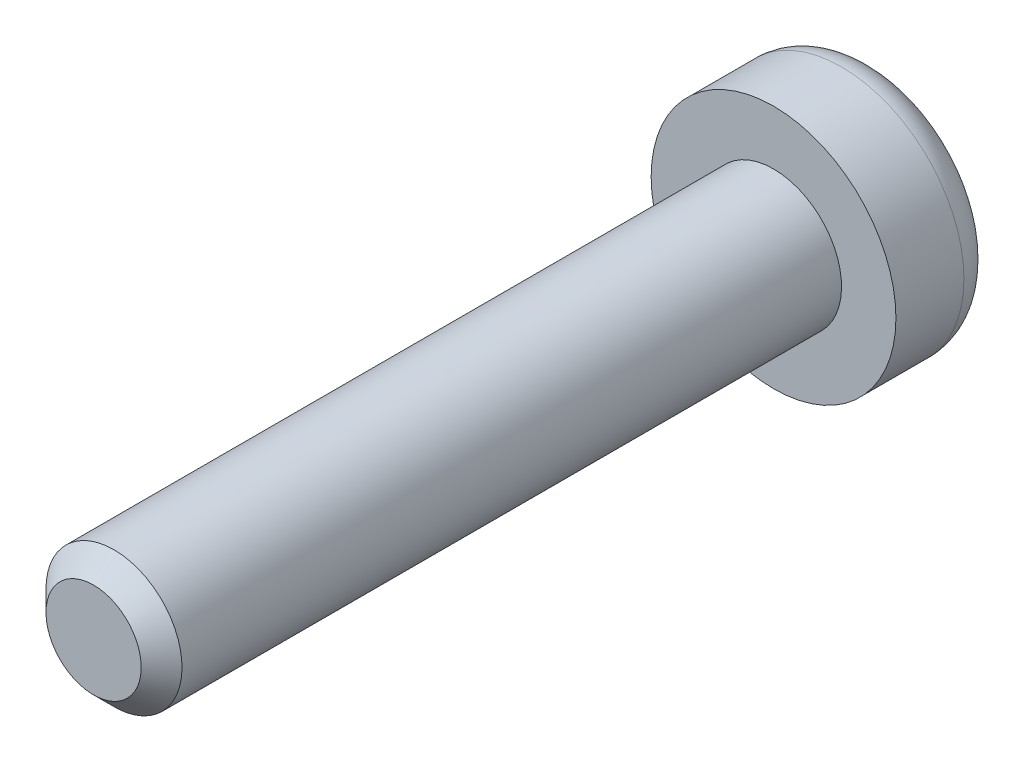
ISO-10303-21;
HEADER;
FILE_DESCRIPTION(('STEP AP214'),'2;1');
FILE_NAME('part.step','',(''),(''),'','','');
FILE_SCHEMA(('AUTOMOTIVE_DESIGN { 1 0 10303 214 1 1 1 1 }'));
ENDSEC;
DATA;
#1=APPLICATION_CONTEXT('core data for automotive mechanical design processes');
#2=APPLICATION_PROTOCOL_DEFINITION('international standard','automotive_design',2000,#1);
#3=PRODUCT_CONTEXT('',#1,'mechanical');
#4=PRODUCT('Part','Part','',(#3));
#5=PRODUCT_RELATED_PRODUCT_CATEGORY('part','',(#4));
#6=PRODUCT_DEFINITION_FORMATION('','',#4);
#7=PRODUCT_DEFINITION_CONTEXT('part definition',#1,'design');
#8=PRODUCT_DEFINITION('design','',#6,#7);
#9=PRODUCT_DEFINITION_SHAPE('','',#8);
#10=(LENGTH_UNIT() NAMED_UNIT(*) SI_UNIT(.MILLI.,.METRE.));
#11=(NAMED_UNIT(*) PLANE_ANGLE_UNIT() SI_UNIT($,.RADIAN.));
#12=(NAMED_UNIT(*) SI_UNIT($,.STERADIAN.) SOLID_ANGLE_UNIT());
#13=UNCERTAINTY_MEASURE_WITH_UNIT(LENGTH_MEASURE(1.E-05),#10,'distance_accuracy_value','');
#14=(GEOMETRIC_REPRESENTATION_CONTEXT(3) GLOBAL_UNCERTAINTY_ASSIGNED_CONTEXT((#13)) GLOBAL_UNIT_ASSIGNED_CONTEXT((#10,
#11,#12)) REPRESENTATION_CONTEXT('',''));
#15=CARTESIAN_POINT('',(0.,0.,0.));
#16=DIRECTION('',(0.,0.,1.));
#17=DIRECTION('',(1.,0.,0.));
#18=AXIS2_PLACEMENT_3D('',#15,#16,#17);
#19=CARTESIAN_POINT('',(1.9,0.,3.));
#20=DIRECTION('',(0.,0.,-1.));
#21=DIRECTION('',(0.,1.,0.));
#22=AXIS2_PLACEMENT_3D('',#19,#20,#21);
#23=PLANE('',#22);
#24=CARTESIAN_POINT('',(0.,0.,3.));
#25=DIRECTION('',(0.,0.,1.));
#26=DIRECTION('',(0.,-1.,0.));
#27=AXIS2_PLACEMENT_3D('',#24,#25,#26);
#28=CIRCLE('',#27,3.6);
#29=CARTESIAN_POINT('',(0.,-3.6,3.));
#30=VERTEX_POINT('',#29);
#31=EDGE_CURVE('E46',#30,#30,#28,.F.);
#32=ORIENTED_EDGE('',*,*,#31,.F.);
#33=EDGE_LOOP('',(#32));
#34=FACE_BOUND('',#33,.T.);
#35=CARTESIAN_POINT('',(0.,0.,3.));
#36=DIRECTION('',(0.,0.,-1.));
#37=DIRECTION('',(0.,1.,0.));
#38=AXIS2_PLACEMENT_3D('',#35,#36,#37);
#39=CIRCLE('',#38,2.);
#40=CARTESIAN_POINT('',(0.,2.,3.));
#41=VERTEX_POINT('',#40);
#42=EDGE_CURVE('E52',#41,#41,#39,.F.);
#43=ORIENTED_EDGE('',*,*,#42,.F.);
#44=EDGE_LOOP('',(#43));
#45=FACE_BOUND('',#44,.T.);
#46=ADVANCED_FACE('F17',(#34,#45),#23,.F.);
#47=CARTESIAN_POINT('',(3.6,0.,0.));
#48=DIRECTION('',(0.,0.,1.));
#49=DIRECTION('',(0.,-1.,0.));
#50=AXIS2_PLACEMENT_3D('',#47,#48,#49);
#51=PLANE('',#50);
#52=CARTESIAN_POINT('',(0.,0.,0.));
#53=DIRECTION('',(0.,0.,1.));
#54=DIRECTION('',(0.,-1.,0.));
#55=AXIS2_PLACEMENT_3D('',#52,#53,#54);
#56=CIRCLE('',#55,2.6);
#57=CARTESIAN_POINT('',(0.,-2.6,0.));
#58=VERTEX_POINT('',#57);
#59=CARTESIAN_POINT('',(0.,2.6,0.));
#60=VERTEX_POINT('',#59);
#61=EDGE_CURVE('E34',#58,#60,#56,.T.);
#62=ORIENTED_EDGE('',*,*,#61,.F.);
#63=CARTESIAN_POINT('',(0.,0.,0.));
#64=DIRECTION('',(0.,0.,1.));
#65=DIRECTION('',(0.,1.,0.));
#66=AXIS2_PLACEMENT_3D('',#63,#64,#65);
#67=CIRCLE('',#66,2.6);
#68=EDGE_CURVE('E31',#60,#58,#67,.T.);
#69=ORIENTED_EDGE('',*,*,#68,.F.);
#70=EDGE_LOOP('',(#62,#69));
#71=FACE_BOUND('',#70,.T.);
#72=ADVANCED_FACE('F36',(#71),#51,.F.);
#73=CARTESIAN_POINT('',(0.,0.,1.));
#74=DIRECTION('',(0.,0.,1.));
#75=DIRECTION('',(0.,-1.,0.));
#76=AXIS2_PLACEMENT_3D('',#73,#74,#75);
#77=TOROIDAL_SURFACE('',#76,2.6,1.);
#78=CARTESIAN_POINT('',(0.,0.,1.));
#79=DIRECTION('',(0.,0.,1.));
#80=DIRECTION('',(0.,-1.,0.));
#81=AXIS2_PLACEMENT_3D('',#78,#79,#80);
#82=CIRCLE('',#81,3.6);
#83=CARTESIAN_POINT('',(0.,-3.6,1.));
#84=VERTEX_POINT('',#83);
#85=EDGE_CURVE('E39',#84,#84,#82,.T.);
#86=ORIENTED_EDGE('',*,*,#85,.F.);
#87=EDGE_LOOP('',(#86));
#88=FACE_BOUND('',#87,.T.);
#89=ORIENTED_EDGE('',*,*,#61,.T.);
#90=ORIENTED_EDGE('',*,*,#68,.T.);
#91=EDGE_LOOP('',(#89,#90));
#92=FACE_BOUND('',#91,.T.);
#93=ADVANCED_FACE('F43',(#88,#92),#77,.T.);
#94=CARTESIAN_POINT('',(0.,0.,23.));
#95=DIRECTION('',(0.,0.,1.));
#96=DIRECTION('',(0.,-1.,0.));
#97=AXIS2_PLACEMENT_3D('',#94,#95,#96);
#98=CYLINDRICAL_SURFACE('',#97,3.6);
#99=ORIENTED_EDGE('',*,*,#31,.T.);
#100=EDGE_LOOP('',(#99));
#101=FACE_BOUND('',#100,.T.);
#102=ORIENTED_EDGE('',*,*,#85,.T.);
#103=EDGE_LOOP('',(#102));
#104=FACE_BOUND('',#103,.T.);
#105=ADVANCED_FACE('F61',(#101,#104),#98,.T.);
#106=CARTESIAN_POINT('',(0.,0.,28.6568542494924));
#107=DIRECTION('',(0.,0.,-1.));
#108=DIRECTION('',(0.,1.,0.));
#109=AXIS2_PLACEMENT_3D('',#106,#107,#108);
#110=CYLINDRICAL_SURFACE('',#109,2.);
#111=CARTESIAN_POINT('',(0.,0.,22.4));
#112=DIRECTION('',(0.,0.,-1.));
#113=DIRECTION('',(0.,1.,0.));
#114=AXIS2_PLACEMENT_3D('',#111,#112,#113);
#115=CIRCLE('',#114,2.);
#116=CARTESIAN_POINT('',(0.,2.,22.4));
#117=VERTEX_POINT('',#116);
#118=EDGE_CURVE('E25',#117,#117,#115,.T.);
#119=ORIENTED_EDGE('',*,*,#118,.T.);
#120=EDGE_LOOP('',(#119));
#121=FACE_BOUND('',#120,.T.);
#122=ORIENTED_EDGE('',*,*,#42,.T.);
#123=EDGE_LOOP('',(#122));
#124=FACE_BOUND('',#123,.T.);
#125=ADVANCED_FACE('F80',(#121,#124),#110,.T.);
#126=CARTESIAN_POINT('',(1.9,0.,23.));
#127=DIRECTION('',(0.,0.,-1.));
#128=DIRECTION('',(0.,1.,0.));
#129=AXIS2_PLACEMENT_3D('',#126,#127,#128);
#130=PLANE('',#129);
#131=CARTESIAN_POINT('',(0.,0.,23.));
#132=DIRECTION('',(0.,0.,-1.));
#133=DIRECTION('',(0.,1.,0.));
#134=AXIS2_PLACEMENT_3D('',#131,#132,#133);
#135=CIRCLE('',#134,1.39999999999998);
#136=CARTESIAN_POINT('',(0.,1.39999999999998,23.));
#137=VERTEX_POINT('',#136);
#138=EDGE_CURVE('E11',#137,#137,#135,.F.);
#139=ORIENTED_EDGE('',*,*,#138,.T.);
#140=EDGE_LOOP('',(#139));
#141=FACE_BOUND('',#140,.T.);
#142=ADVANCED_FACE('F83',(#141),#130,.F.);
#143=CARTESIAN_POINT('',(0.,0.,22.4));
#144=DIRECTION('',(0.,0.,-1.));
#145=DIRECTION('',(0.,1.,0.));
#146=AXIS2_PLACEMENT_3D('',#143,#144,#145);
#147=CONICAL_SURFACE('',#146,2.,0.78539816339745);
#148=ORIENTED_EDGE('',*,*,#138,.F.);
#149=EDGE_LOOP('',(#148));
#150=FACE_BOUND('',#149,.T.);
#151=ORIENTED_EDGE('',*,*,#118,.F.);
#152=EDGE_LOOP('',(#151));
#153=FACE_BOUND('',#152,.T.);
#154=ADVANCED_FACE('F19',(#150,#153),#147,.T.);
#155=CLOSED_SHELL('',(#46,#72,#93,#105,#125,#142,#154));
#156=MANIFOLD_SOLID_BREP('B1',#155);
#157=ADVANCED_BREP_SHAPE_REPRESENTATION('',(#18,#156),#14);
#158=SHAPE_DEFINITION_REPRESENTATION(#9,#157);
ENDSEC;
END-ISO-10303-21;
